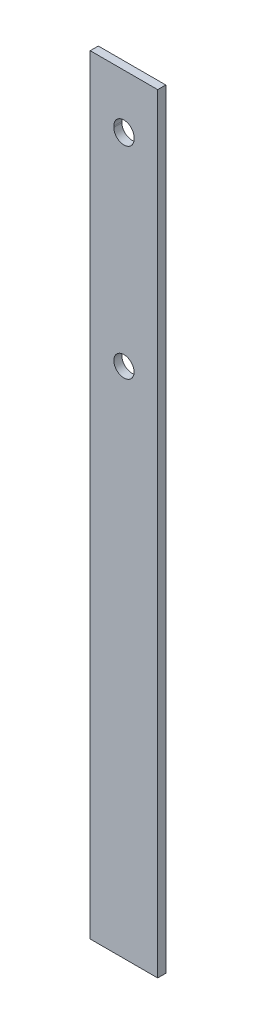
from build123d import *

# Parameters (mm, degrees)
SKETCH3_W                      = 6
SKETCH3_H                      = 50
EXTRUDE_H_JD_DEPTH             = 370
CUT_H_L_MOT_STOLPE_DEPTH       = 371.855767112
CUT_H_L_MOT_STOLPE_DEPTH_BACK  = 371.855767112
SKETCH4_R                      = 7.5
SKETCH5_W                      = 50
SKETCH5_H                      = 6
EXTRUDE_F_RANKRINGSL_NGD_DEPTH = 200


with BuildPart() as part:
    # Sketch3 → Extrude h_jd (new body)
    with BuildSketch(Plane(origin=(0, 0, 0), x_dir=(0, 0, -1), z_dir=(0, 1, 0))):
        Rectangle(SKETCH3_W, SKETCH3_H)
    extrude(amount=EXTRUDE_H_JD_DEPTH)

    # Sketch4 → Cut h_l mot stolpe (cut, two sides: drawn at the far end of the back side and taken through both)
    with BuildSketch(Plane.XY.offset(-CUT_H_L_MOT_STOLPE_DEPTH_BACK)):
        with Locations((0, 180)):
            Circle(SKETCH4_R)
        with BuildLine():
            Line((7.5, 329.5), (7.5, 330.5))
            ThreePointArc((7.5, 330.5), (0, 338), (-7.5, 330.5))
            Line((-7.5, 330.5), (-7.5, 329.5))
            ThreePointArc((-7.5, 329.5), (0, 322), (7.5, 329.5))
        make_face()
    extrude(amount=CUT_H_L_MOT_STOLPE_DEPTH + CUT_H_L_MOT_STOLPE_DEPTH_BACK, mode=Mode.SUBTRACT)

    # Sketch5 → Extrude f_rankringsl_ngd (add)
    with BuildSketch(Plane.XZ):
        Rectangle(SKETCH5_W, SKETCH5_H)
    extrude(amount=EXTRUDE_F_RANKRINGSL_NGD_DEPTH)


solid = part.part
